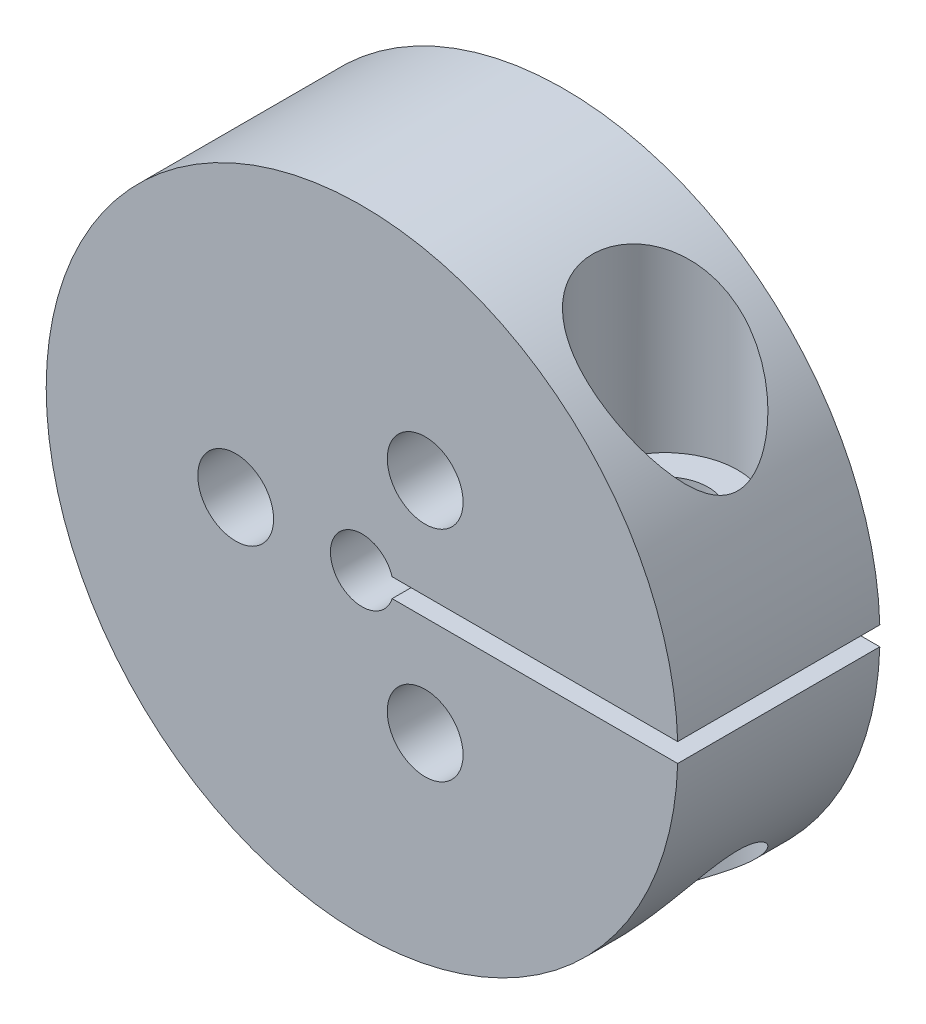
ISO-10303-21;
HEADER;
FILE_DESCRIPTION(('STEP AP214'),'2;1');
FILE_NAME('part.step','',(''),(''),'','','');
FILE_SCHEMA(('AUTOMOTIVE_DESIGN { 1 0 10303 214 1 1 1 1 }'));
ENDSEC;
DATA;
#1=APPLICATION_CONTEXT('core data for automotive mechanical design processes');
#2=APPLICATION_PROTOCOL_DEFINITION('international standard','automotive_design',2000,#1);
#3=PRODUCT_CONTEXT('',#1,'mechanical');
#4=PRODUCT('Part','Part','',(#3));
#5=PRODUCT_RELATED_PRODUCT_CATEGORY('part','',(#4));
#6=PRODUCT_DEFINITION_FORMATION('','',#4);
#7=PRODUCT_DEFINITION_CONTEXT('part definition',#1,'design');
#8=PRODUCT_DEFINITION('design','',#6,#7);
#9=PRODUCT_DEFINITION_SHAPE('','',#8);
#10=(LENGTH_UNIT() NAMED_UNIT(*) SI_UNIT(.MILLI.,.METRE.));
#11=(NAMED_UNIT(*) PLANE_ANGLE_UNIT() SI_UNIT($,.RADIAN.));
#12=(NAMED_UNIT(*) SI_UNIT($,.STERADIAN.) SOLID_ANGLE_UNIT());
#13=UNCERTAINTY_MEASURE_WITH_UNIT(LENGTH_MEASURE(1.E-05),#10,'distance_accuracy_value','');
#14=(GEOMETRIC_REPRESENTATION_CONTEXT(3) GLOBAL_UNCERTAINTY_ASSIGNED_CONTEXT((#13)) GLOBAL_UNIT_ASSIGNED_CONTEXT((#10,
#11,#12)) REPRESENTATION_CONTEXT('',''));
#15=CARTESIAN_POINT('',(0.,0.,0.));
#16=DIRECTION('',(0.,0.,1.));
#17=DIRECTION('',(1.,0.,0.));
#18=AXIS2_PLACEMENT_3D('',#15,#16,#17);
#19=CARTESIAN_POINT('',(8.,-12.5,0.));
#20=DIRECTION('',(0.,1.,0.));
#21=DIRECTION('',(0.,0.,1.));
#22=AXIS2_PLACEMENT_3D('',#19,#20,#21);
#23=CYLINDRICAL_SURFACE('',#22,1.55);
#24=CARTESIAN_POINT('',(8.,-0.375,0.));
#25=DIRECTION('',(0.,1.,0.));
#26=DIRECTION('',(0.,0.,1.));
#27=AXIS2_PLACEMENT_3D('',#24,#25,#26);
#28=CIRCLE('',#27,1.55);
#29=CARTESIAN_POINT('',(8.,-0.375,1.55));
#30=VERTEX_POINT('',#29);
#31=EDGE_CURVE('E123',#30,#30,#28,.T.);
#32=ORIENTED_EDGE('',*,*,#31,.T.);
#33=EDGE_LOOP('',(#32));
#34=FACE_BOUND('',#33,.T.);
#35=CARTESIAN_POINT('',(8.,-4.,0.));
#36=DIRECTION('',(0.,-1.,0.));
#37=DIRECTION('',(0.,0.,-1.));
#38=AXIS2_PLACEMENT_3D('',#35,#36,#37);
#39=CIRCLE('',#38,1.55);
#40=CARTESIAN_POINT('',(8.,-4.,-1.55));
#41=VERTEX_POINT('',#40);
#42=EDGE_CURVE('E136',#41,#41,#39,.F.);
#43=ORIENTED_EDGE('',*,*,#42,.F.);
#44=EDGE_LOOP('',(#43));
#45=FACE_BOUND('',#44,.T.);
#46=ADVANCED_FACE('F45',(#34,#45),#23,.F.);
#47=CARTESIAN_POINT('',(0.,0.,4.));
#48=DIRECTION('',(0.,0.,-1.));
#49=DIRECTION('',(-1.,0.,0.));
#50=AXIS2_PLACEMENT_3D('',#47,#48,#49);
#51=CYLINDRICAL_SURFACE('',#50,12.5);
#52=CARTESIAN_POINT('',(8.,-9.60468635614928,2.875));
#53=CARTESIAN_POINT('',(8.1864175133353,-9.44940514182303,2.87500158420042));
#54=CARTESIAN_POINT('',(8.36841423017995,-9.28855816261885,2.85688274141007));
#55=CARTESIAN_POINT('',(8.71995989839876,-8.95938613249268,2.78917273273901));
#56=CARTESIAN_POINT('',(8.88947054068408,-8.79104041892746,2.73948887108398));
#57=CARTESIAN_POINT('',(9.1458220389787,-8.52189588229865,2.63874470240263));
#58=CARTESIAN_POINT('',(9.23763027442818,-8.42224055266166,2.59691962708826));
#59=CARTESIAN_POINT('',(9.4159300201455,-8.22241890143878,2.50417023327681));
#60=CARTESIAN_POINT('',(9.50242238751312,-8.12225266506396,2.45324738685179));
#61=CARTESIAN_POINT('',(9.66980878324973,-7.92223398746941,2.34252673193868));
#62=CARTESIAN_POINT('',(9.75070535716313,-7.82238142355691,2.28273299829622));
#63=CARTESIAN_POINT('',(9.90662820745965,-7.62395267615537,2.15420414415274));
#64=CARTESIAN_POINT('',(9.98165666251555,-7.52537603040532,2.08547236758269));
#65=CARTESIAN_POINT('',(10.1477809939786,-7.30051622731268,1.91593672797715));
#66=CARTESIAN_POINT('',(10.2366880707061,-7.17507282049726,1.81178168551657));
#67=CARTESIAN_POINT('',(10.3609080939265,-6.99335454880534,1.64213994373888));
#68=CARTESIAN_POINT('',(10.4007828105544,-6.93386985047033,1.58337364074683));
#69=CARTESIAN_POINT('',(10.4771858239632,-6.81787279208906,1.46095255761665));
#70=CARTESIAN_POINT('',(10.5137153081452,-6.76135938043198,1.39729952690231));
#71=CARTESIAN_POINT('',(10.5947460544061,-6.63391305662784,1.24216540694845));
#72=CARTESIAN_POINT('',(10.6377601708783,-6.56457452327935,1.14855799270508));
#73=CARTESIAN_POINT('',(10.71533460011,-6.43716935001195,0.950698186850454));
#74=CARTESIAN_POINT('',(10.749909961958,-6.37908268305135,0.846465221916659));
#75=CARTESIAN_POINT('',(10.800076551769,-6.29365615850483,0.657238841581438));
#76=CARTESIAN_POINT('',(10.8182736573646,-6.26225275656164,0.574804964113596));
#77=CARTESIAN_POINT('',(10.8476055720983,-6.21130636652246,0.405150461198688));
#78=CARTESIAN_POINT('',(10.8587509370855,-6.19174565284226,0.317937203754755));
#79=CARTESIAN_POINT('',(10.8729807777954,-6.16672662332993,0.140049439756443));
#80=CARTESIAN_POINT('',(10.8759987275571,-6.16138469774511,0.0493524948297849));
#81=CARTESIAN_POINT('',(10.8734138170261,-6.16594485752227,-0.131543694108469));
#82=CARTESIAN_POINT('',(10.8678089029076,-6.17585057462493,-0.221742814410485));
#83=CARTESIAN_POINT('',(10.8496683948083,-6.20765417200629,-0.38902536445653));
#84=CARTESIAN_POINT('',(10.8379410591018,-6.22815113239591,-0.466477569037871));
#85=CARTESIAN_POINT('',(10.8090065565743,-6.27823359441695,-0.617257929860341));
#86=CARTESIAN_POINT('',(10.791797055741,-6.30782296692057,-0.690584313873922));
#87=CARTESIAN_POINT('',(10.7387762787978,-6.39788924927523,-0.883604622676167));
#88=CARTESIAN_POINT('',(10.6984787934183,-6.46529326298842,-0.998808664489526));
#89=CARTESIAN_POINT('',(10.607745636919,-6.61311645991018,-1.2162495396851));
#90=CARTESIAN_POINT('',(10.5572722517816,-6.69358383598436,-1.31843575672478));
#91=CARTESIAN_POINT('',(10.4551803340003,-6.85178394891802,-1.49901392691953));
#92=CARTESIAN_POINT('',(10.4045083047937,-6.92858261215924,-1.57878152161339));
#93=CARTESIAN_POINT('',(10.2977961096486,-7.08621642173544,-1.73042279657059));
#94=CARTESIAN_POINT('',(10.2417519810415,-7.16705452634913,-1.80229056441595));
#95=CARTESIAN_POINT('',(10.1247800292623,-7.33137207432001,-1.93881865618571));
#96=CARTESIAN_POINT('',(10.0638477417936,-7.41485388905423,-2.00347225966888));
#97=CARTESIAN_POINT('',(9.93748503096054,-7.58336891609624,-2.12591462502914));
#98=CARTESIAN_POINT('',(9.87205571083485,-7.6684017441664,-2.1837050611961));
#99=CARTESIAN_POINT('',(9.73179893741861,-7.84575148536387,-2.29678314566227));
#100=CARTESIAN_POINT('',(9.65663492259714,-7.93813324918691,-2.35155162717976));
#101=CARTESIAN_POINT('',(9.50155593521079,-8.12311586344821,-2.45348016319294));
#102=CARTESIAN_POINT('',(9.42164046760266,-8.2157167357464,-2.50063942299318));
#103=CARTESIAN_POINT('',(9.25730675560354,-8.40044800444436,-2.58716381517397));
#104=CARTESIAN_POINT('',(9.17289190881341,-8.4925786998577,-2.62653472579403));
#105=CARTESIAN_POINT('',(8.99973507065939,-8.67586994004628,-2.69720381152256));
#106=CARTESIAN_POINT('',(8.91099162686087,-8.76703014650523,-2.72849925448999));
#107=CARTESIAN_POINT('',(8.63997235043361,-9.03688093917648,-2.80916156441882));
#108=CARTESIAN_POINT('',(8.45152453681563,-9.21350577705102,-2.84604224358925));
#109=CARTESIAN_POINT('',(8.15955923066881,-9.47040276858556,-2.87223016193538));
#110=CARTESIAN_POINT('',(8.06068051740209,-9.55470126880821,-2.87610312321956));
#111=CARTESIAN_POINT('',(7.86043656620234,-9.7201017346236,-2.87335576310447));
#112=CARTESIAN_POINT('',(7.75907198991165,-9.80120453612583,-2.86673820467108));
#113=CARTESIAN_POINT('',(7.49618480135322,-10.0049185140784,-2.83513099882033));
#114=CARTESIAN_POINT('',(7.3333933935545,-10.1247583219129,-2.80180218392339));
#115=CARTESIAN_POINT('',(7.00867507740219,-10.3521816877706,-2.70399141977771));
#116=CARTESIAN_POINT('',(6.84674734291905,-10.4597803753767,-2.63954845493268));
#117=CARTESIAN_POINT('',(6.55437617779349,-10.644974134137,-2.48968775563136));
#118=CARTESIAN_POINT('',(6.42287650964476,-10.7246455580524,-2.4089199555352));
#119=CARTESIAN_POINT('',(6.17042556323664,-10.8718528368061,-2.22324036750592));
#120=CARTESIAN_POINT('',(6.04947183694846,-10.939391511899,-2.11833420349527));
#121=CARTESIAN_POINT('',(5.82318955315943,-11.0615155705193,-1.88511138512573));
#122=CARTESIAN_POINT('',(5.71794420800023,-11.1160328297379,-1.7566775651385));
#123=CARTESIAN_POINT('',(5.52948234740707,-11.2109776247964,-1.47991720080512));
#124=CARTESIAN_POINT('',(5.44625820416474,-11.2514100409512,-1.3315975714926));
#125=CARTESIAN_POINT('',(5.31333083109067,-11.3147436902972,-1.03501579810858));
#126=CARTESIAN_POINT('',(5.26116492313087,-11.3389617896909,-0.888134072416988));
#127=CARTESIAN_POINT('',(5.18114400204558,-11.3757511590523,-0.586508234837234));
#128=CARTESIAN_POINT('',(5.15328052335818,-11.3883264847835,-0.431766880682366));
#129=CARTESIAN_POINT('',(5.12394974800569,-11.4015515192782,-0.127220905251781));
#130=CARTESIAN_POINT('',(5.12122270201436,-11.4027704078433,0.0224393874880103));
#131=CARTESIAN_POINT('',(5.13898807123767,-11.3947749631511,0.320080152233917));
#132=CARTESIAN_POINT('',(5.15947726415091,-11.3855620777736,0.468060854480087));
#133=CARTESIAN_POINT('',(5.22245105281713,-11.3568116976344,0.756591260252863));
#134=CARTESIAN_POINT('',(5.2647068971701,-11.3373815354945,0.897201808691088));
#135=CARTESIAN_POINT('',(5.36928079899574,-11.28823018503,1.16881173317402));
#136=CARTESIAN_POINT('',(5.43159907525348,-11.2585088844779,1.29981100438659));
#137=CARTESIAN_POINT('',(5.57501629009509,-11.1881928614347,1.55126193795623));
#138=CARTESIAN_POINT('',(5.65644133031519,-11.1474071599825,1.67147364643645));
#139=CARTESIAN_POINT('',(5.83402036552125,-11.0555045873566,1.89595740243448));
#140=CARTESIAN_POINT('',(5.9301760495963,-11.0043865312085,2.00022761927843));
#141=CARTESIAN_POINT('',(6.13926691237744,-10.8891875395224,2.1965906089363));
#142=CARTESIAN_POINT('',(6.25284270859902,-10.8245379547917,2.28766440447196));
#143=CARTESIAN_POINT('',(6.4880331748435,-10.6852291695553,2.44948769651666));
#144=CARTESIAN_POINT('',(6.60965234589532,-10.6105643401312,2.52022569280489));
#145=CARTESIAN_POINT('',(6.8709951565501,-10.4434711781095,2.64848846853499));
#146=CARTESIAN_POINT('',(7.01121227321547,-10.3499890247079,2.70361885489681));
#147=CARTESIAN_POINT('',(7.29232542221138,-10.1538840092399,2.79042479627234));
#148=CARTESIAN_POINT('',(7.43322121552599,-10.0512641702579,2.82210807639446));
#149=CARTESIAN_POINT('',(7.64490512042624,-9.89008013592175,2.85391957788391));
#150=CARTESIAN_POINT('',(7.71667088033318,-9.8341895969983,2.86189774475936));
#151=CARTESIAN_POINT('',(7.8591657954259,-9.72068989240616,2.87243617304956));
#152=CARTESIAN_POINT('',(7.92989549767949,-9.6630816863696,2.87499940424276));
#153=CARTESIAN_POINT('',(8.,-9.60468635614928,2.875));
#154=B_SPLINE_CURVE_WITH_KNOTS('',3,(#52,#53,#54,#55,#56,#57,#58,#59,#60,#61,#62,#63,#64,#65,
#66,#67,#68,#69,#70,#71,#72,#73,#74,#75,#76,#77,#78,#79,#80,#81,#82,#83,#84,#85,#86,#87,#88,#89,
#90,#91,#92,#93,#94,#95,#96,#97,#98,#99,#100,#101,#102,#103,#104,#105,#106,#107,#108,#109,#110,
#111,#112,#113,#114,#115,#116,#117,#118,#119,#120,#121,#122,#123,#124,#125,#126,#127,#128,#129,
#130,#131,#132,#133,#134,#135,#136,#137,#138,#139,#140,#141,#142,#143,#144,#145,#146,#147,#148,
#149,#150,#151,#152,#153),.UNSPECIFIED.,.T.,.F.,(4,2,2,2,2,2,2,2,2,2,2,2,2,2,2,2,2,2,2,2,2,2,2,
2,2,2,2,2,2,2,2,2,2,2,2,2,2,2,2,2,2,2,2,2,2,2,2,2,2,2,4),(0.,0.727603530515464,1.45735372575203,
1.88242711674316,2.3074317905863,2.73224183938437,3.15689341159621,3.7126198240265,
3.99034893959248,4.26797908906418,4.63958641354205,5.0105261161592,5.27977175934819,
5.54861340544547,5.81964902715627,6.09074921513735,6.33275817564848,6.57487030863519,
6.99073784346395,7.40817598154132,7.77298984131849,8.13807490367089,8.50349727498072,
8.86883031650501,9.26177157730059,9.65475384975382,10.0474434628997,10.440265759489,
11.2193223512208,11.6089109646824,11.9983969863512,12.6105064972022,13.2218510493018,
13.7406803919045,14.2593889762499,14.7807546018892,15.3019393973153,15.772742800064,
16.24338213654,16.6902980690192,17.137151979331,17.5794027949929,18.0216584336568,
18.4720954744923,18.9225842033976,19.3984897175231,19.8746638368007,20.4046137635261,
20.9343890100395,21.2081630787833,21.4817869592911),.UNSPECIFIED.);
#155=CARTESIAN_POINT('',(8.,-9.60468635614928,2.875));
#156=VERTEX_POINT('',#155);
#157=EDGE_CURVE('E49',#156,#156,#154,.T.);
#158=ORIENTED_EDGE('',*,*,#157,.T.);
#159=EDGE_LOOP('',(#158));
#160=FACE_BOUND('',#159,.T.);
#161=CARTESIAN_POINT('',(0.,0.,-4.));
#162=DIRECTION('',(0.,0.,1.));
#163=DIRECTION('',(1.,0.,0.));
#164=AXIS2_PLACEMENT_3D('',#161,#162,#163);
#165=CIRCLE('',#164,12.5);
#166=CARTESIAN_POINT('',(12.4943737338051,0.375,-4.));
#167=VERTEX_POINT('',#166);
#168=CARTESIAN_POINT('',(12.4943737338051,-0.375,-4.));
#169=VERTEX_POINT('',#168);
#170=EDGE_CURVE('E170',#167,#169,#165,.T.);
#171=ORIENTED_EDGE('',*,*,#170,.T.);
#172=DIRECTION('',(0.,0.,-1.));
#173=VECTOR('',#172,1.);
#174=CARTESIAN_POINT('',(12.4943737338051,-0.375,4.));
#175=LINE('',#174,#173);
#176=CARTESIAN_POINT('',(12.4943737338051,-0.375,4.));
#177=VERTEX_POINT('',#176);
#178=EDGE_CURVE('E84',#177,#169,#175,.T.);
#179=ORIENTED_EDGE('',*,*,#178,.F.);
#180=CARTESIAN_POINT('',(0.,0.,4.));
#181=DIRECTION('',(0.,0.,1.));
#182=DIRECTION('',(1.,0.,0.));
#183=AXIS2_PLACEMENT_3D('',#180,#181,#182);
#184=CIRCLE('',#183,12.5);
#185=CARTESIAN_POINT('',(12.4943737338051,0.375,4.));
#186=VERTEX_POINT('',#185);
#187=EDGE_CURVE('E96',#186,#177,#184,.T.);
#188=ORIENTED_EDGE('',*,*,#187,.F.);
#189=DIRECTION('',(0.,0.,-1.));
#190=VECTOR('',#189,1.);
#191=CARTESIAN_POINT('',(12.4943737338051,0.375,4.));
#192=LINE('',#191,#190);
#193=EDGE_CURVE('E61',#186,#167,#192,.T.);
#194=ORIENTED_EDGE('',*,*,#193,.T.);
#195=EDGE_LOOP('',(#171,#179,#188,#194));
#196=FACE_BOUND('',#195,.T.);
#197=CARTESIAN_POINT('',(8.,9.60468635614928,-2.875));
#198=CARTESIAN_POINT('',(7.90586483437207,9.68309790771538,-2.87499953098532));
#199=CARTESIAN_POINT('',(7.81059049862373,9.76010322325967,-2.87037905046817));
#200=CARTESIAN_POINT('',(7.61845841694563,9.91080040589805,-2.8512041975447));
#201=CARTESIAN_POINT('',(7.521601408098,9.98449375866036,-2.83665432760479));
#202=CARTESIAN_POINT('',(7.32728053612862,10.1279577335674,-2.7969437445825));
#203=CARTESIAN_POINT('',(7.22981736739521,10.1977321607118,-2.77179353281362));
#204=CARTESIAN_POINT('',(7.03540096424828,10.3328193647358,-2.71027109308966));
#205=CARTESIAN_POINT('',(6.938447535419,10.398133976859,-2.67390351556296));
#206=CARTESIAN_POINT('',(6.70379257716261,10.5516108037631,-2.57067597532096));
#207=CARTESIAN_POINT('',(6.56705452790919,10.6370859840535,-2.49744452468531));
#208=CARTESIAN_POINT('',(6.30254544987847,10.795911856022,-2.32573863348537));
#209=CARTESIAN_POINT('',(6.17476953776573,10.8692691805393,-2.22727807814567));
#210=CARTESIAN_POINT('',(5.99397135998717,10.9693732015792,-2.06113258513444));
#211=CARTESIAN_POINT('',(5.93532977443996,11.0011798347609,-2.00243612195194));
#212=CARTESIAN_POINT('',(5.82257396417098,11.0612701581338,-1.87920261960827));
#213=CARTESIAN_POINT('',(5.76845769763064,11.0895554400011,-1.81466824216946));
#214=CARTESIAN_POINT('',(5.66548848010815,11.1425131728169,-1.68013539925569));
#215=CARTESIAN_POINT('',(5.61663569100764,11.1671855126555,-1.61013676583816));
#216=CARTESIAN_POINT('',(5.52490747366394,11.2128505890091,-1.46523267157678));
#217=CARTESIAN_POINT('',(5.48203139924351,11.2338437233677,-1.39032774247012));
#218=CARTESIAN_POINT('',(5.37141602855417,11.2873447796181,-1.17485739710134));
#219=CARTESIAN_POINT('',(5.31097535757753,11.3157558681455,-1.02939191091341));
#220=CARTESIAN_POINT('',(5.21447036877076,11.3605531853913,-0.728946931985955));
#221=CARTESIAN_POINT('',(5.17839658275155,11.3769440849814,-0.573971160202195));
#222=CARTESIAN_POINT('',(5.13368318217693,11.3971862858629,-0.268733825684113));
#223=CARTESIAN_POINT('',(5.12354608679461,11.4017223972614,-0.118736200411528));
#224=CARTESIAN_POINT('',(5.12679033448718,11.4002644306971,0.180935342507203));
#225=CARTESIAN_POINT('',(5.14016774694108,11.3942721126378,0.330609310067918));
#226=CARTESIAN_POINT('',(5.18946261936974,11.3719031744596,0.62302230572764));
#227=CARTESIAN_POINT('',(5.22503384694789,11.3556860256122,0.765832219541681));
#228=CARTESIAN_POINT('',(5.31688143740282,11.312971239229,1.04298265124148));
#229=CARTESIAN_POINT('',(5.37315746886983,11.2864737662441,1.17732330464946));
#230=CARTESIAN_POINT('',(5.50495694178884,11.2227827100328,1.4358724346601));
#231=CARTESIAN_POINT('',(5.58073547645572,11.1854464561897,1.55991534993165));
#232=CARTESIAN_POINT('',(5.74797476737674,11.1004307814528,1.79292702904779));
#233=CARTESIAN_POINT('',(5.83943761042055,11.0527499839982,1.90189378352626));
#234=CARTESIAN_POINT('',(6.03929186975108,10.9448819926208,2.10780410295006));
#235=CARTESIAN_POINT('',(6.1482966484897,10.8841930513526,2.20388695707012));
#236=CARTESIAN_POINT('',(6.37541434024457,10.7527351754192,2.37627840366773));
#237=CARTESIAN_POINT('',(6.49353000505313,10.6819631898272,2.4525809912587));
#238=CARTESIAN_POINT('',(6.74736336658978,10.5236716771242,2.5922214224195));
#239=CARTESIAN_POINT('',(6.8836428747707,10.4351785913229,2.65342249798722));
#240=CARTESIAN_POINT('',(7.15816268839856,10.248817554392,2.75286778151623));
#241=CARTESIAN_POINT('',(7.29640421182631,10.1509435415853,2.79109702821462));
#242=CARTESIAN_POINT('',(7.5326426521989,9.97619354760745,2.83854932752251));
#243=CARTESIAN_POINT('',(7.63102188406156,9.90115509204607,2.85290665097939));
#244=CARTESIAN_POINT('',(7.82610065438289,9.74769634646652,2.87140851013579));
#245=CARTESIAN_POINT('',(7.92279961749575,9.66927492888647,2.87554961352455));
#246=CARTESIAN_POINT('',(8.20951178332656,9.4295163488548,2.87372470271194));
#247=CARTESIAN_POINT('',(8.39596490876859,9.26381440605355,2.85347828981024));
#248=CARTESIAN_POINT('',(8.68718261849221,8.98925288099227,2.79400170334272));
#249=CARTESIAN_POINT('',(8.79625287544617,8.88250380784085,2.76480048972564));
#250=CARTESIAN_POINT('',(9.00856507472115,8.66709612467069,2.69460718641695));
#251=CARTESIAN_POINT('',(9.11180829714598,8.55843794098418,2.65361769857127));
#252=CARTESIAN_POINT('',(9.3121661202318,8.33999887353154,2.56048318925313));
#253=CARTESIAN_POINT('',(9.40927228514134,8.2302166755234,2.50832322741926));
#254=CARTESIAN_POINT('',(9.59687080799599,8.01067384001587,2.39326872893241));
#255=CARTESIAN_POINT('',(9.68736516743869,7.90091320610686,2.33037746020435));
#256=CARTESIAN_POINT('',(9.84251135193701,7.70629138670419,2.20868080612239));
#257=CARTESIAN_POINT('',(9.90850859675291,7.62119743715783,2.15195220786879));
#258=CARTESIAN_POINT('',(10.036029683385,7.45246810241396,2.03172055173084));
#259=CARTESIAN_POINT('',(10.097554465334,7.36883241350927,1.96821892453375));
#260=CARTESIAN_POINT('',(10.215679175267,7.20417479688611,1.83421655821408));
#261=CARTESIAN_POINT('',(10.272291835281,7.12314647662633,1.76373499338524));
#262=CARTESIAN_POINT('',(10.3802748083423,6.96484454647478,1.61504047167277));
#263=CARTESIAN_POINT('',(10.4316488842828,6.88756826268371,1.53683314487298));
#264=CARTESIAN_POINT('',(10.5287608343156,6.73818766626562,1.3712307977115));
#265=CARTESIAN_POINT('',(10.574461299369,6.66611886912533,1.28378117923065));
#266=CARTESIAN_POINT('',(10.658593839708,6.53075081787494,1.09899743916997));
#267=CARTESIAN_POINT('',(10.697030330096,6.46744624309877,1.00166937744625));
#268=CARTESIAN_POINT('',(10.7582852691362,6.36491817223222,0.815593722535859));
#269=CARTESIAN_POINT('',(10.7826805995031,6.32340508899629,0.728653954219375));
#270=CARTESIAN_POINT('',(10.8237701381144,6.25281399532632,0.548142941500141));
#271=CARTESIAN_POINT('',(10.8404797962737,6.22371104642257,0.454585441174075));
#272=CARTESIAN_POINT('',(10.8624867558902,6.18520742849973,0.279553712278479));
#273=CARTESIAN_POINT('',(10.8692721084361,6.17324565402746,0.198839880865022));
#274=CARTESIAN_POINT('',(10.8759198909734,6.16152734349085,0.0362535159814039));
#275=CARTESIAN_POINT('',(10.87578634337,6.16176371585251,-0.0456183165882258));
#276=CARTESIAN_POINT('',(10.8686200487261,6.17439414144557,-0.20794665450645));
#277=CARTESIAN_POINT('',(10.8615981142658,6.18676914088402,-0.288405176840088));
#278=CARTESIAN_POINT('',(10.8412977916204,6.22227229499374,-0.446086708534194));
#279=CARTESIAN_POINT('',(10.8280129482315,6.24541154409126,-0.523306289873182));
#280=CARTESIAN_POINT('',(10.7885545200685,6.31341878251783,-0.708757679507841));
#281=CARTESIAN_POINT('',(10.7592571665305,6.36338770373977,-0.814431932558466));
#282=CARTESIAN_POINT('',(10.6917498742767,6.47617213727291,-1.01560157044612));
#283=CARTESIAN_POINT('',(10.6535145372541,6.53902419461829,-1.11106679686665));
#284=CARTESIAN_POINT('',(10.5760636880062,6.66344262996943,-1.27937743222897));
#285=CARTESIAN_POINT('',(10.5377804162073,6.7238933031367,-1.35350123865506));
#286=CARTESIAN_POINT('',(10.4568092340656,6.84913898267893,-1.49545896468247));
#287=CARTESIAN_POINT('',(10.4141181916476,6.91393706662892,-1.56328834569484));
#288=CARTESIAN_POINT('',(10.3247679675,7.04667183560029,-1.69331386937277));
#289=CARTESIAN_POINT('',(10.2781007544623,7.11461474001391,-1.75549806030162));
#290=CARTESIAN_POINT('',(10.1811987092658,7.2526071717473,-1.87453613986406));
#291=CARTESIAN_POINT('',(10.1309628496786,7.32265730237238,-1.93138848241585));
#292=CARTESIAN_POINT('',(10.000073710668,7.50108867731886,-2.06843438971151));
#293=CARTESIAN_POINT('',(9.91722367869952,7.61040280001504,-2.14533270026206));
#294=CARTESIAN_POINT('',(9.74432220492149,7.83056910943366,-2.28812889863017));
#295=CARTESIAN_POINT('',(9.65426702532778,7.94142206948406,-2.35402102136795));
#296=CARTESIAN_POINT('',(9.46745939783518,8.16322256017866,-2.47478050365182));
#297=CARTESIAN_POINT('',(9.37071547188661,8.2741697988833,-2.52966155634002));
#298=CARTESIAN_POINT('',(9.17082481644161,8.49518569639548,-2.62815512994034));
#299=CARTESIAN_POINT('',(9.06768081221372,8.60525470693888,-2.67177240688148));
#300=CARTESIAN_POINT('',(8.8121307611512,8.86804312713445,-2.76246314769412));
#301=CARTESIAN_POINT('',(8.65673838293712,9.01991872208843,-2.80373881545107));
#302=CARTESIAN_POINT('',(8.33546349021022,9.31761315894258,-2.86000865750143));
#303=CARTESIAN_POINT('',(8.16958018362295,9.46343154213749,-2.87500084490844));
#304=CARTESIAN_POINT('',(8.,9.60468635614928,-2.875));
#305=B_SPLINE_CURVE_WITH_KNOTS('',3,(#197,#198,#199,#200,#201,#202,#203,#204,#205,#206,#207,
#208,#209,#210,#211,#212,#213,#214,#215,#216,#217,#218,#219,#220,#221,#222,#223,#224,#225,#226,
#227,#228,#229,#230,#231,#232,#233,#234,#235,#236,#237,#238,#239,#240,#241,#242,#243,#244,#245,
#246,#247,#248,#249,#250,#251,#252,#253,#254,#255,#256,#257,#258,#259,#260,#261,#262,#263,#264,
#265,#266,#267,#268,#269,#270,#271,#272,#273,#274,#275,#276,#277,#278,#279,#280,#281,#282,#283,
#284,#285,#286,#287,#288,#289,#290,#291,#292,#293,#294,#295,#296,#297,#298,#299,#300,#301,#302,
#303,#304),.UNSPECIFIED.,.T.,.F.,(4,2,2,2,2,2,2,2,2,2,2,2,2,2,2,2,2,2,2,2,2,2,2,2,2,2,2,2,2,2,2,
2,2,2,2,2,2,2,2,2,2,2,2,2,2,2,2,2,2,2,2,2,2,4),(0.,0.367384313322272,0.734602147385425,
1.10145704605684,1.46816006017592,1.99721398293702,2.52597735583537,2.79223469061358,
3.05837123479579,3.3245159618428,3.59063189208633,4.06810174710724,4.54538596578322,
4.99441900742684,5.44337699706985,5.8855003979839,6.32761672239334,6.77583915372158,
7.22412126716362,7.69456517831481,8.16515173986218,8.68407581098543,9.2033374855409,
9.57653799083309,9.94986386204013,10.6971685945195,11.1628599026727,11.628448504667,
12.0946637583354,12.5607372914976,12.9256339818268,13.2904537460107,13.6542977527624,
14.0178785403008,14.3837418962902,14.7493821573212,15.0465307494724,15.3430793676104,
15.587592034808,15.8319625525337,16.0759500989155,16.3201896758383,16.6796638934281,
17.0401722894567,17.3488201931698,17.6576889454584,17.9671970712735,18.276794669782,
18.7478991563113,19.2192496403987,19.6900102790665,20.1605718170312,20.8223477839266,
21.4841737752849),.UNSPECIFIED.);
#306=CARTESIAN_POINT('',(8.,9.60468635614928,-2.875));
#307=VERTEX_POINT('',#306);
#308=EDGE_CURVE('E128',#307,#307,#305,.T.);
#309=ORIENTED_EDGE('',*,*,#308,.F.);
#310=EDGE_LOOP('',(#309));
#311=FACE_BOUND('',#310,.T.);
#312=ADVANCED_FACE('F98',(#160,#196,#311),#51,.T.);
#313=CARTESIAN_POINT('',(0.,0.,4.));
#314=DIRECTION('',(0.,0.,-1.));
#315=DIRECTION('',(-1.,0.,0.));
#316=AXIS2_PLACEMENT_3D('',#313,#314,#315);
#317=CYLINDRICAL_SURFACE('',#316,1.25);
#318=CARTESIAN_POINT('',(0.,0.,-4.));
#319=DIRECTION('',(0.,0.,1.));
#320=DIRECTION('',(1.,0.,0.));
#321=AXIS2_PLACEMENT_3D('',#318,#319,#320);
#322=CIRCLE('',#321,1.25);
#323=CARTESIAN_POINT('',(1.19242400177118,0.375,-4.));
#324=VERTEX_POINT('',#323);
#325=CARTESIAN_POINT('',(1.19242400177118,-0.375,-4.));
#326=VERTEX_POINT('',#325);
#327=EDGE_CURVE('E194',#324,#326,#322,.T.);
#328=ORIENTED_EDGE('',*,*,#327,.F.);
#329=DIRECTION('',(0.,0.,-1.));
#330=VECTOR('',#329,1.);
#331=CARTESIAN_POINT('',(1.19242400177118,0.375,4.));
#332=LINE('',#331,#330);
#333=CARTESIAN_POINT('',(1.19242400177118,0.375,4.));
#334=VERTEX_POINT('',#333);
#335=EDGE_CURVE('E11',#334,#324,#332,.T.);
#336=ORIENTED_EDGE('',*,*,#335,.F.);
#337=CARTESIAN_POINT('',(0.,0.,4.));
#338=DIRECTION('',(0.,0.,1.));
#339=DIRECTION('',(1.,0.,0.));
#340=AXIS2_PLACEMENT_3D('',#337,#338,#339);
#341=CIRCLE('',#340,1.25);
#342=CARTESIAN_POINT('',(1.19242400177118,-0.375,4.));
#343=VERTEX_POINT('',#342);
#344=EDGE_CURVE('E110',#334,#343,#341,.T.);
#345=ORIENTED_EDGE('',*,*,#344,.T.);
#346=DIRECTION('',(0.,0.,-1.));
#347=VECTOR('',#346,1.);
#348=CARTESIAN_POINT('',(1.19242400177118,-0.375,4.));
#349=LINE('',#348,#347);
#350=EDGE_CURVE('E70',#343,#326,#349,.T.);
#351=ORIENTED_EDGE('',*,*,#350,.T.);
#352=EDGE_LOOP('',(#328,#336,#345,#351));
#353=FACE_BOUND('',#352,.T.);
#354=ADVANCED_FACE('F227',(#353),#317,.F.);
#355=CARTESIAN_POINT('',(0.,0.375,4.));
#356=DIRECTION('',(0.,1.,0.));
#357=DIRECTION('',(0.,0.,1.));
#358=AXIS2_PLACEMENT_3D('',#355,#356,#357);
#359=PLANE('',#358);
#360=CARTESIAN_POINT('',(8.,0.375,0.));
#361=DIRECTION('',(0.,1.,0.));
#362=DIRECTION('',(0.,0.,1.));
#363=AXIS2_PLACEMENT_3D('',#360,#361,#362);
#364=CIRCLE('',#363,1.7);
#365=CARTESIAN_POINT('',(8.,0.375,1.7));
#366=VERTEX_POINT('',#365);
#367=EDGE_CURVE('E208',#366,#366,#364,.F.);
#368=ORIENTED_EDGE('',*,*,#367,.F.);
#369=EDGE_LOOP('',(#368));
#370=FACE_BOUND('',#369,.T.);
#371=DIRECTION('',(1.,0.,0.));
#372=VECTOR('',#371,1.);
#373=CARTESIAN_POINT('',(0.,0.375,-4.));
#374=LINE('',#373,#372);
#375=EDGE_CURVE('E116',#324,#167,#374,.T.);
#376=ORIENTED_EDGE('',*,*,#375,.T.);
#377=ORIENTED_EDGE('',*,*,#193,.F.);
#378=DIRECTION('',(1.,0.,0.));
#379=VECTOR('',#378,1.);
#380=CARTESIAN_POINT('',(0.,0.375,4.));
#381=LINE('',#380,#379);
#382=EDGE_CURVE('E106',#334,#186,#381,.T.);
#383=ORIENTED_EDGE('',*,*,#382,.F.);
#384=ORIENTED_EDGE('',*,*,#335,.T.);
#385=EDGE_LOOP('',(#376,#377,#383,#384));
#386=FACE_BOUND('',#385,.T.);
#387=ADVANCED_FACE('F114',(#370,#386),#359,.F.);
#388=CARTESIAN_POINT('',(2.50000000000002,4.33012701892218,4.));
#389=DIRECTION('',(0.,0.,-1.));
#390=DIRECTION('',(-1.,0.,0.));
#391=AXIS2_PLACEMENT_3D('',#388,#389,#390);
#392=CYLINDRICAL_SURFACE('',#391,1.5);
#393=CARTESIAN_POINT('',(2.50000000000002,4.33012701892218,4.));
#394=DIRECTION('',(0.,0.,1.));
#395=DIRECTION('',(1.,0.,0.));
#396=AXIS2_PLACEMENT_3D('',#393,#394,#395);
#397=CIRCLE('',#396,1.5);
#398=CARTESIAN_POINT('',(4.00000000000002,4.33012701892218,4.));
#399=VERTEX_POINT('',#398);
#400=EDGE_CURVE('E222',#399,#399,#397,.T.);
#401=ORIENTED_EDGE('',*,*,#400,.T.);
#402=EDGE_LOOP('',(#401));
#403=FACE_BOUND('',#402,.T.);
#404=CARTESIAN_POINT('',(2.50000000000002,4.33012701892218,-4.));
#405=DIRECTION('',(0.,0.,1.));
#406=DIRECTION('',(1.,0.,0.));
#407=AXIS2_PLACEMENT_3D('',#404,#405,#406);
#408=CIRCLE('',#407,1.5);
#409=CARTESIAN_POINT('',(4.00000000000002,4.33012701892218,-4.));
#410=VERTEX_POINT('',#409);
#411=EDGE_CURVE('E190',#410,#410,#408,.T.);
#412=ORIENTED_EDGE('',*,*,#411,.F.);
#413=EDGE_LOOP('',(#412));
#414=FACE_BOUND('',#413,.T.);
#415=ADVANCED_FACE('F234',(#403,#414),#392,.F.);
#416=CARTESIAN_POINT('',(2.50000000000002,-4.33012701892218,4.));
#417=DIRECTION('',(0.,0.,-1.));
#418=DIRECTION('',(-1.,0.,0.));
#419=AXIS2_PLACEMENT_3D('',#416,#417,#418);
#420=CYLINDRICAL_SURFACE('',#419,1.50000000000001);
#421=CARTESIAN_POINT('',(2.50000000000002,-4.33012701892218,4.));
#422=DIRECTION('',(0.,0.,1.));
#423=DIRECTION('',(1.,0.,0.));
#424=AXIS2_PLACEMENT_3D('',#421,#422,#423);
#425=CIRCLE('',#424,1.50000000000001);
#426=CARTESIAN_POINT('',(4.00000000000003,-4.33012701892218,4.));
#427=VERTEX_POINT('',#426);
#428=EDGE_CURVE('E175',#427,#427,#425,.T.);
#429=ORIENTED_EDGE('',*,*,#428,.T.);
#430=EDGE_LOOP('',(#429));
#431=FACE_BOUND('',#430,.T.);
#432=CARTESIAN_POINT('',(2.50000000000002,-4.33012701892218,-4.));
#433=DIRECTION('',(0.,0.,1.));
#434=DIRECTION('',(1.,0.,0.));
#435=AXIS2_PLACEMENT_3D('',#432,#433,#434);
#436=CIRCLE('',#435,1.50000000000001);
#437=CARTESIAN_POINT('',(4.00000000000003,-4.33012701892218,-4.));
#438=VERTEX_POINT('',#437);
#439=EDGE_CURVE('E186',#438,#438,#436,.T.);
#440=ORIENTED_EDGE('',*,*,#439,.F.);
#441=EDGE_LOOP('',(#440));
#442=FACE_BOUND('',#441,.T.);
#443=ADVANCED_FACE('F162',(#431,#442),#420,.F.);
#444=CARTESIAN_POINT('',(-5.,0.,4.));
#445=DIRECTION('',(0.,0.,-1.));
#446=DIRECTION('',(-1.,0.,0.));
#447=AXIS2_PLACEMENT_3D('',#444,#445,#446);
#448=CYLINDRICAL_SURFACE('',#447,1.5);
#449=CARTESIAN_POINT('',(-5.,0.,4.));
#450=DIRECTION('',(0.,0.,1.));
#451=DIRECTION('',(1.,0.,0.));
#452=AXIS2_PLACEMENT_3D('',#449,#450,#451);
#453=CIRCLE('',#452,1.5);
#454=CARTESIAN_POINT('',(-3.5,0.,4.));
#455=VERTEX_POINT('',#454);
#456=EDGE_CURVE('E169',#455,#455,#453,.T.);
#457=ORIENTED_EDGE('',*,*,#456,.T.);
#458=EDGE_LOOP('',(#457));
#459=FACE_BOUND('',#458,.T.);
#460=CARTESIAN_POINT('',(-5.,0.,-4.));
#461=DIRECTION('',(0.,0.,1.));
#462=DIRECTION('',(1.,0.,0.));
#463=AXIS2_PLACEMENT_3D('',#460,#461,#462);
#464=CIRCLE('',#463,1.5);
#465=CARTESIAN_POINT('',(-3.5,0.,-4.));
#466=VERTEX_POINT('',#465);
#467=EDGE_CURVE('E127',#466,#466,#464,.T.);
#468=ORIENTED_EDGE('',*,*,#467,.F.);
#469=EDGE_LOOP('',(#468));
#470=FACE_BOUND('',#469,.T.);
#471=ADVANCED_FACE('F47',(#459,#470),#448,.F.);
#472=CARTESIAN_POINT('',(0.,-0.375,4.));
#473=DIRECTION('',(0.,1.,0.));
#474=DIRECTION('',(0.,0.,1.));
#475=AXIS2_PLACEMENT_3D('',#472,#473,#474);
#476=PLANE('',#475);
#477=ORIENTED_EDGE('',*,*,#31,.F.);
#478=EDGE_LOOP('',(#477));
#479=FACE_BOUND('',#478,.T.);
#480=DIRECTION('',(1.,0.,0.));
#481=VECTOR('',#480,1.);
#482=CARTESIAN_POINT('',(0.,-0.375,-4.));
#483=LINE('',#482,#481);
#484=EDGE_CURVE('E166',#326,#169,#483,.T.);
#485=ORIENTED_EDGE('',*,*,#484,.F.);
#486=ORIENTED_EDGE('',*,*,#350,.F.);
#487=DIRECTION('',(1.,0.,0.));
#488=VECTOR('',#487,1.);
#489=CARTESIAN_POINT('',(0.,-0.375,4.));
#490=LINE('',#489,#488);
#491=EDGE_CURVE('E105',#343,#177,#490,.T.);
#492=ORIENTED_EDGE('',*,*,#491,.T.);
#493=ORIENTED_EDGE('',*,*,#178,.T.);
#494=EDGE_LOOP('',(#485,#486,#492,#493));
#495=FACE_BOUND('',#494,.T.);
#496=ADVANCED_FACE('F153',(#479,#495),#476,.T.);
#497=CARTESIAN_POINT('',(0.,0.,4.));
#498=DIRECTION('',(0.,0.,1.));
#499=DIRECTION('',(1.,0.,0.));
#500=AXIS2_PLACEMENT_3D('',#497,#498,#499);
#501=PLANE('',#500);
#502=ORIENTED_EDGE('',*,*,#456,.F.);
#503=EDGE_LOOP('',(#502));
#504=FACE_BOUND('',#503,.T.);
#505=ORIENTED_EDGE('',*,*,#428,.F.);
#506=EDGE_LOOP('',(#505));
#507=FACE_BOUND('',#506,.T.);
#508=ORIENTED_EDGE('',*,*,#400,.F.);
#509=EDGE_LOOP('',(#508));
#510=FACE_BOUND('',#509,.T.);
#511=ORIENTED_EDGE('',*,*,#344,.F.);
#512=ORIENTED_EDGE('',*,*,#382,.T.);
#513=ORIENTED_EDGE('',*,*,#187,.T.);
#514=ORIENTED_EDGE('',*,*,#491,.F.);
#515=EDGE_LOOP('',(#511,#512,#513,#514));
#516=FACE_BOUND('',#515,.T.);
#517=ADVANCED_FACE('F109',(#504,#507,#510,#516),#501,.T.);
#518=CARTESIAN_POINT('',(0.,0.,-4.));
#519=DIRECTION('',(0.,0.,1.));
#520=DIRECTION('',(1.,0.,0.));
#521=AXIS2_PLACEMENT_3D('',#518,#519,#520);
#522=PLANE('',#521);
#523=ORIENTED_EDGE('',*,*,#467,.T.);
#524=EDGE_LOOP('',(#523));
#525=FACE_BOUND('',#524,.T.);
#526=ORIENTED_EDGE('',*,*,#439,.T.);
#527=EDGE_LOOP('',(#526));
#528=FACE_BOUND('',#527,.T.);
#529=ORIENTED_EDGE('',*,*,#411,.T.);
#530=EDGE_LOOP('',(#529));
#531=FACE_BOUND('',#530,.T.);
#532=ORIENTED_EDGE('',*,*,#327,.T.);
#533=ORIENTED_EDGE('',*,*,#484,.T.);
#534=ORIENTED_EDGE('',*,*,#170,.F.);
#535=ORIENTED_EDGE('',*,*,#375,.F.);
#536=EDGE_LOOP('',(#532,#533,#534,#535));
#537=FACE_BOUND('',#536,.T.);
#538=ADVANCED_FACE('F146',(#525,#528,#531,#537),#522,.F.);
#539=CARTESIAN_POINT('',(8.,12.5,0.));
#540=DIRECTION('',(0.,-1.,0.));
#541=DIRECTION('',(0.,0.,-1.));
#542=AXIS2_PLACEMENT_3D('',#539,#540,#541);
#543=CYLINDRICAL_SURFACE('',#542,2.875);
#544=CARTESIAN_POINT('',(8.,4.,0.));
#545=DIRECTION('',(0.,1.,0.));
#546=DIRECTION('',(0.,0.,1.));
#547=AXIS2_PLACEMENT_3D('',#544,#545,#546);
#548=CIRCLE('',#547,2.875);
#549=CARTESIAN_POINT('',(8.,4.,2.875));
#550=VERTEX_POINT('',#549);
#551=EDGE_CURVE('E135',#550,#550,#548,.T.);
#552=ORIENTED_EDGE('',*,*,#551,.F.);
#553=EDGE_LOOP('',(#552));
#554=FACE_BOUND('',#553,.T.);
#555=ORIENTED_EDGE('',*,*,#308,.T.);
#556=EDGE_LOOP('',(#555));
#557=FACE_BOUND('',#556,.T.);
#558=ADVANCED_FACE('F140',(#554,#557),#543,.F.);
#559=CARTESIAN_POINT('',(8.,4.,0.));
#560=DIRECTION('',(0.,1.,0.));
#561=DIRECTION('',(0.,0.,1.));
#562=AXIS2_PLACEMENT_3D('',#559,#560,#561);
#563=PLANE('',#562);
#564=CARTESIAN_POINT('',(8.,4.,0.));
#565=DIRECTION('',(0.,1.,0.));
#566=DIRECTION('',(0.,0.,1.));
#567=AXIS2_PLACEMENT_3D('',#564,#565,#566);
#568=CIRCLE('',#567,1.7);
#569=CARTESIAN_POINT('',(8.,4.,1.7));
#570=VERTEX_POINT('',#569);
#571=EDGE_CURVE('E212',#570,#570,#568,.T.);
#572=ORIENTED_EDGE('',*,*,#571,.F.);
#573=EDGE_LOOP('',(#572));
#574=FACE_BOUND('',#573,.T.);
#575=ORIENTED_EDGE('',*,*,#551,.T.);
#576=EDGE_LOOP('',(#575));
#577=FACE_BOUND('',#576,.T.);
#578=ADVANCED_FACE('F145',(#574,#577),#563,.T.);
#579=CARTESIAN_POINT('',(8.,-12.5,0.));
#580=DIRECTION('',(0.,1.,0.));
#581=DIRECTION('',(0.,0.,1.));
#582=AXIS2_PLACEMENT_3D('',#579,#580,#581);
#583=CYLINDRICAL_SURFACE('',#582,2.875);
#584=CARTESIAN_POINT('',(8.,-4.,0.));
#585=DIRECTION('',(0.,1.,0.));
#586=DIRECTION('',(0.,0.,1.));
#587=AXIS2_PLACEMENT_3D('',#584,#585,#586);
#588=CIRCLE('',#587,2.875);
#589=CARTESIAN_POINT('',(8.,-4.,2.875));
#590=VERTEX_POINT('',#589);
#591=EDGE_CURVE('E205',#590,#590,#588,.T.);
#592=ORIENTED_EDGE('',*,*,#591,.T.);
#593=EDGE_LOOP('',(#592));
#594=FACE_BOUND('',#593,.T.);
#595=ORIENTED_EDGE('',*,*,#157,.F.);
#596=EDGE_LOOP('',(#595));
#597=FACE_BOUND('',#596,.T.);
#598=ADVANCED_FACE('F308',(#594,#597),#583,.F.);
#599=CARTESIAN_POINT('',(8.,-4.,0.));
#600=DIRECTION('',(0.,-1.,0.));
#601=DIRECTION('',(0.,0.,1.));
#602=AXIS2_PLACEMENT_3D('',#599,#600,#601);
#603=PLANE('',#602);
#604=ORIENTED_EDGE('',*,*,#591,.F.);
#605=EDGE_LOOP('',(#604));
#606=FACE_BOUND('',#605,.T.);
#607=ORIENTED_EDGE('',*,*,#42,.T.);
#608=EDGE_LOOP('',(#607));
#609=FACE_BOUND('',#608,.T.);
#610=ADVANCED_FACE('F313',(#606,#609),#603,.T.);
#611=CARTESIAN_POINT('',(8.,-12.501,0.));
#612=DIRECTION('',(0.,1.,0.));
#613=DIRECTION('',(0.,0.,1.));
#614=AXIS2_PLACEMENT_3D('',#611,#612,#613);
#615=CYLINDRICAL_SURFACE('',#614,1.7);
#616=ORIENTED_EDGE('',*,*,#571,.T.);
#617=EDGE_LOOP('',(#616));
#618=FACE_BOUND('',#617,.T.);
#619=ORIENTED_EDGE('',*,*,#367,.T.);
#620=EDGE_LOOP('',(#619));
#621=FACE_BOUND('',#620,.T.);
#622=ADVANCED_FACE('F322',(#618,#621),#615,.F.);
#623=CLOSED_SHELL('',(#46,#312,#354,#387,#415,#443,#471,#496,#517,#538,#558,#578,#598,#610,#622));
#624=MANIFOLD_SOLID_BREP('B2',#623);
#625=ADVANCED_BREP_SHAPE_REPRESENTATION('',(#18,#624),#14);
#626=SHAPE_DEFINITION_REPRESENTATION(#9,#625);
ENDSEC;
END-ISO-10303-21;
